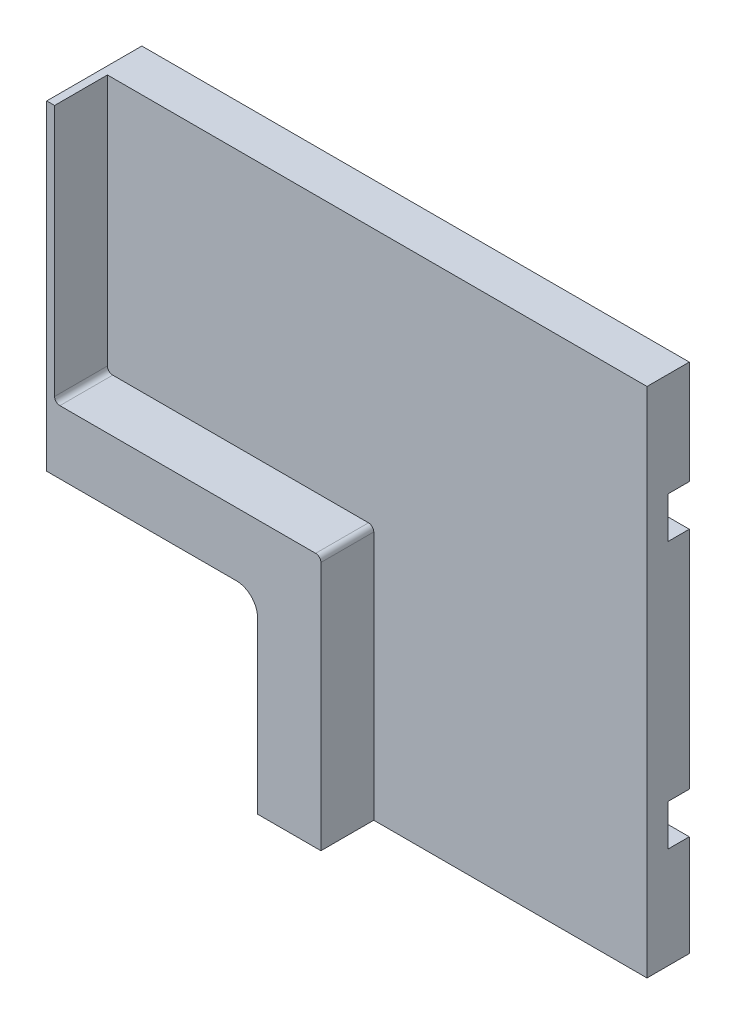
ISO-10303-21;
HEADER;
FILE_DESCRIPTION(('STEP AP214'),'2;1');
FILE_NAME('part.step','',(''),(''),'','','');
FILE_SCHEMA(('AUTOMOTIVE_DESIGN { 1 0 10303 214 1 1 1 1 }'));
ENDSEC;
DATA;
#1=APPLICATION_CONTEXT('core data for automotive mechanical design processes');
#2=APPLICATION_PROTOCOL_DEFINITION('international standard','automotive_design',2000,#1);
#3=PRODUCT_CONTEXT('',#1,'mechanical');
#4=PRODUCT('Part','Part','',(#3));
#5=PRODUCT_RELATED_PRODUCT_CATEGORY('part','',(#4));
#6=PRODUCT_DEFINITION_FORMATION('','',#4);
#7=PRODUCT_DEFINITION_CONTEXT('part definition',#1,'design');
#8=PRODUCT_DEFINITION('design','',#6,#7);
#9=PRODUCT_DEFINITION_SHAPE('','',#8);
#10=(LENGTH_UNIT() NAMED_UNIT(*) SI_UNIT(.MILLI.,.METRE.));
#11=(NAMED_UNIT(*) PLANE_ANGLE_UNIT() SI_UNIT($,.RADIAN.));
#12=(NAMED_UNIT(*) SI_UNIT($,.STERADIAN.) SOLID_ANGLE_UNIT());
#13=UNCERTAINTY_MEASURE_WITH_UNIT(LENGTH_MEASURE(1.E-05),#10,'distance_accuracy_value','');
#14=(GEOMETRIC_REPRESENTATION_CONTEXT(3) GLOBAL_UNCERTAINTY_ASSIGNED_CONTEXT((#13)) GLOBAL_UNIT_ASSIGNED_CONTEXT((#10,
#11,#12)) REPRESENTATION_CONTEXT('',''));
#15=CARTESIAN_POINT('',(0.,0.,0.));
#16=DIRECTION('',(0.,0.,1.));
#17=DIRECTION('',(1.,0.,0.));
#18=AXIS2_PLACEMENT_3D('',#15,#16,#17);
#19=CARTESIAN_POINT('',(0.,0.,4.));
#20=DIRECTION('',(0.,0.,1.));
#21=DIRECTION('',(1.,0.,0.));
#22=AXIS2_PLACEMENT_3D('',#19,#20,#21);
#23=PLANE('',#22);
#24=DIRECTION('',(0.,1.,0.));
#25=VECTOR('',#24,1.);
#26=CARTESIAN_POINT('',(-24.5501886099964,0.,4.));
#27=LINE('',#26,#25);
#28=CARTESIAN_POINT('',(-24.5501886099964,-74.52170155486,4.));
#29=VERTEX_POINT('',#28);
#30=CARTESIAN_POINT('',(-24.5501886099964,-26.0548775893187,4.));
#31=VERTEX_POINT('',#30);
#32=EDGE_CURVE('E315',#29,#31,#27,.T.);
#33=ORIENTED_EDGE('',*,*,#32,.T.);
#34=DIRECTION('',(-1.,0.,0.));
#35=VECTOR('',#34,1.);
#36=CARTESIAN_POINT('',(0.,-26.0548775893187,4.));
#37=LINE('',#36,#35);
#38=CARTESIAN_POINT('',(-75.6,-26.0548775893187,4.));
#39=VERTEX_POINT('',#38);
#40=EDGE_CURVE('E334',#31,#39,#37,.T.);
#41=ORIENTED_EDGE('',*,*,#40,.T.);
#42=DIRECTION('',(0.,-1.,0.));
#43=VECTOR('',#42,1.);
#44=CARTESIAN_POINT('',(-75.6,50.4000000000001,4.));
#45=LINE('',#44,#43);
#46=CARTESIAN_POINT('',(-75.6,-49.9,4.));
#47=VERTEX_POINT('',#46);
#48=EDGE_CURVE('E430',#39,#47,#45,.T.);
#49=ORIENTED_EDGE('',*,*,#48,.T.);
#50=CARTESIAN_POINT('',(-75.1,-49.9000000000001,4.));
#51=DIRECTION('',(0.,0.,1.));
#52=DIRECTION('',(1.,0.,0.));
#53=AXIS2_PLACEMENT_3D('',#50,#51,#52);
#54=CIRCLE('',#53,0.5);
#55=CARTESIAN_POINT('',(-75.1,-50.4000000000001,4.));
#56=VERTEX_POINT('',#55);
#57=EDGE_CURVE('E573',#47,#56,#54,.T.);
#58=ORIENTED_EDGE('',*,*,#57,.T.);
#59=DIRECTION('',(1.,0.,0.));
#60=VECTOR('',#59,1.);
#61=CARTESIAN_POINT('',(-75.6,-50.4000000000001,4.));
#62=LINE('',#61,#60);
#63=CARTESIAN_POINT('',(-50.9,-50.4000000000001,4.));
#64=VERTEX_POINT('',#63);
#65=EDGE_CURVE('E543',#56,#64,#62,.T.);
#66=ORIENTED_EDGE('',*,*,#65,.T.);
#67=CARTESIAN_POINT('',(-50.9,-50.9000000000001,4.));
#68=DIRECTION('',(0.,0.,1.));
#69=DIRECTION('',(1.,0.,0.));
#70=AXIS2_PLACEMENT_3D('',#67,#68,#69);
#71=CIRCLE('',#70,0.5);
#72=CARTESIAN_POINT('',(-50.4,-50.9000000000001,4.));
#73=VERTEX_POINT('',#72);
#74=EDGE_CURVE('E590',#64,#73,#71,.F.);
#75=ORIENTED_EDGE('',*,*,#74,.T.);
#76=DIRECTION('',(0.,-1.,0.));
#77=VECTOR('',#76,1.);
#78=CARTESIAN_POINT('',(-50.4,-50.4000000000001,4.));
#79=LINE('',#78,#77);
#80=CARTESIAN_POINT('',(-50.4,-74.52170155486,4.));
#81=VERTEX_POINT('',#80);
#82=EDGE_CURVE('E538',#73,#81,#79,.T.);
#83=ORIENTED_EDGE('',*,*,#82,.T.);
#84=DIRECTION('',(1.,0.,0.));
#85=VECTOR('',#84,1.);
#86=CARTESIAN_POINT('',(0.,-74.52170155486,4.));
#87=LINE('',#86,#85);
#88=EDGE_CURVE('E323',#81,#29,#87,.T.);
#89=ORIENTED_EDGE('',*,*,#88,.T.);
#90=EDGE_LOOP('',(#33,#41,#49,#58,#66,#75,#83,#89));
#91=FACE_BOUND('',#90,.T.);
#92=ADVANCED_FACE('F49',(#91),#23,.T.);
#93=CARTESIAN_POINT('',(0.,0.,9.));
#94=DIRECTION('',(0.,0.,1.));
#95=DIRECTION('',(1.,0.,0.));
#96=AXIS2_PLACEMENT_3D('',#93,#94,#95);
#97=PLANE('',#96);
#98=DIRECTION('',(0.,-1.,0.));
#99=VECTOR('',#98,1.);
#100=CARTESIAN_POINT('',(-75.6,50.4000000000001,9.00000000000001));
#101=LINE('',#100,#99);
#102=CARTESIAN_POINT('',(-75.6,-26.0548775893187,9.00000000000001));
#103=VERTEX_POINT('',#102);
#104=CARTESIAN_POINT('',(-75.6,-49.9000000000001,9.00000000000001));
#105=VERTEX_POINT('',#104);
#106=EDGE_CURVE('E542',#103,#105,#101,.T.);
#107=ORIENTED_EDGE('',*,*,#106,.F.);
#108=DIRECTION('',(-1.,0.,0.));
#109=VECTOR('',#108,1.);
#110=CARTESIAN_POINT('',(0.,-26.0548775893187,9.));
#111=LINE('',#110,#109);
#112=CARTESIAN_POINT('',(-76.3431671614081,-26.0548775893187,9.));
#113=VERTEX_POINT('',#112);
#114=EDGE_CURVE('E331',#103,#113,#111,.T.);
#115=ORIENTED_EDGE('',*,*,#114,.T.);
#116=DIRECTION('',(0.,-1.,0.));
#117=VECTOR('',#116,1.);
#118=CARTESIAN_POINT('',(-76.3431671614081,0.,9.));
#119=LINE('',#118,#117);
#120=CARTESIAN_POINT('',(-76.3431671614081,-56.4000000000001,9.00000000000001));
#121=VERTEX_POINT('',#120);
#122=EDGE_CURVE('E272',#113,#121,#119,.T.);
#123=ORIENTED_EDGE('',*,*,#122,.T.);
#124=DIRECTION('',(1.,0.,0.));
#125=VECTOR('',#124,1.);
#126=CARTESIAN_POINT('',(-81.6,-56.4000000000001,9.));
#127=LINE('',#126,#125);
#128=CARTESIAN_POINT('',(-58.4,-56.4000000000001,9.));
#129=VERTEX_POINT('',#128);
#130=EDGE_CURVE('E553',#121,#129,#127,.T.);
#131=ORIENTED_EDGE('',*,*,#130,.T.);
#132=CARTESIAN_POINT('',(-58.4,-58.4000000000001,9.00000000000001));
#133=DIRECTION('',(0.,0.,1.));
#134=DIRECTION('',(1.,0.,0.));
#135=AXIS2_PLACEMENT_3D('',#132,#133,#134);
#136=CIRCLE('',#135,2.);
#137=CARTESIAN_POINT('',(-56.4,-58.4000000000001,9.));
#138=VERTEX_POINT('',#137);
#139=EDGE_CURVE('E604',#129,#138,#136,.F.);
#140=ORIENTED_EDGE('',*,*,#139,.T.);
#141=DIRECTION('',(0.,-1.,0.));
#142=VECTOR('',#141,1.);
#143=CARTESIAN_POINT('',(-56.4,-56.4000000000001,9.));
#144=LINE('',#143,#142);
#145=CARTESIAN_POINT('',(-56.4,-74.52170155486,9.));
#146=VERTEX_POINT('',#145);
#147=EDGE_CURVE('E562',#138,#146,#144,.T.);
#148=ORIENTED_EDGE('',*,*,#147,.T.);
#149=DIRECTION('',(1.,0.,0.));
#150=VECTOR('',#149,1.);
#151=CARTESIAN_POINT('',(0.,-74.52170155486,9.));
#152=LINE('',#151,#150);
#153=CARTESIAN_POINT('',(-50.4,-74.52170155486,9.00000000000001));
#154=VERTEX_POINT('',#153);
#155=EDGE_CURVE('E319',#146,#154,#152,.T.);
#156=ORIENTED_EDGE('',*,*,#155,.T.);
#157=DIRECTION('',(0.,-1.,0.));
#158=VECTOR('',#157,1.);
#159=CARTESIAN_POINT('',(-50.4,-50.4000000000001,9.00000000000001));
#160=LINE('',#159,#158);
#161=CARTESIAN_POINT('',(-50.4,-50.9000000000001,9.00000000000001));
#162=VERTEX_POINT('',#161);
#163=EDGE_CURVE('E549',#162,#154,#160,.T.);
#164=ORIENTED_EDGE('',*,*,#163,.F.);
#165=CARTESIAN_POINT('',(-50.9,-50.9000000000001,9.00000000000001));
#166=DIRECTION('',(0.,0.,1.));
#167=DIRECTION('',(1.,0.,0.));
#168=AXIS2_PLACEMENT_3D('',#165,#166,#167);
#169=CIRCLE('',#168,0.5);
#170=CARTESIAN_POINT('',(-50.9,-50.4000000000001,9.00000000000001));
#171=VERTEX_POINT('',#170);
#172=EDGE_CURVE('E583',#162,#171,#169,.T.);
#173=ORIENTED_EDGE('',*,*,#172,.T.);
#174=DIRECTION('',(1.,0.,0.));
#175=VECTOR('',#174,1.);
#176=CARTESIAN_POINT('',(-75.6,-50.4000000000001,9.00000000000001));
#177=LINE('',#176,#175);
#178=CARTESIAN_POINT('',(-75.1,-50.4000000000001,9.00000000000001));
#179=VERTEX_POINT('',#178);
#180=EDGE_CURVE('E554',#179,#171,#177,.T.);
#181=ORIENTED_EDGE('',*,*,#180,.F.);
#182=CARTESIAN_POINT('',(-75.1,-49.9000000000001,9.00000000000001));
#183=DIRECTION('',(0.,0.,1.));
#184=DIRECTION('',(1.,0.,0.));
#185=AXIS2_PLACEMENT_3D('',#182,#183,#184);
#186=CIRCLE('',#185,0.5);
#187=EDGE_CURVE('E593',#179,#105,#186,.F.);
#188=ORIENTED_EDGE('',*,*,#187,.T.);
#189=EDGE_LOOP('',(#107,#115,#123,#131,#140,#148,#156,#164,#173,#181,#188));
#190=FACE_BOUND('',#189,.T.);
#191=ADVANCED_FACE('F678',(#190),#97,.T.);
#192=CARTESIAN_POINT('',(-56.4,-56.4000000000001,-230.799653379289));
#193=DIRECTION('',(-1.,0.,0.));
#194=DIRECTION('',(0.,-1.,0.));
#195=AXIS2_PLACEMENT_3D('',#192,#193,#194);
#196=PLANE('',#195);
#197=DIRECTION('',(0.,1.,0.));
#198=VECTOR('',#197,1.);
#199=CARTESIAN_POINT('',(-56.4,-56.4000000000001,0.));
#200=LINE('',#199,#198);
#201=CARTESIAN_POINT('',(-56.4,-74.52170155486,0.));
#202=VERTEX_POINT('',#201);
#203=CARTESIAN_POINT('',(-56.4,-58.4000000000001,0.));
#204=VERTEX_POINT('',#203);
#205=EDGE_CURVE('E73',#202,#204,#200,.T.);
#206=ORIENTED_EDGE('',*,*,#205,.F.);
#207=DIRECTION('',(0.,0.,1.));
#208=VECTOR('',#207,1.);
#209=CARTESIAN_POINT('',(-56.4,-74.52170155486,-230.799653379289));
#210=LINE('',#209,#208);
#211=EDGE_CURVE('E327',#202,#146,#210,.T.);
#212=ORIENTED_EDGE('',*,*,#211,.T.);
#213=ORIENTED_EDGE('',*,*,#147,.F.);
#214=DIRECTION('',(0.,0.,1.));
#215=VECTOR('',#214,1.);
#216=CARTESIAN_POINT('',(-56.4,-58.4000000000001,0.));
#217=LINE('',#216,#215);
#218=EDGE_CURVE('E601',#138,#204,#217,.F.);
#219=ORIENTED_EDGE('',*,*,#218,.T.);
#220=EDGE_LOOP('',(#206,#212,#213,#219));
#221=FACE_BOUND('',#220,.T.);
#222=ADVANCED_FACE('F685',(#221),#196,.T.);
#223=CARTESIAN_POINT('',(-81.6,-56.4000000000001,-230.799653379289));
#224=DIRECTION('',(0.,-1.,0.));
#225=DIRECTION('',(0.,0.,-1.));
#226=AXIS2_PLACEMENT_3D('',#223,#224,#225);
#227=PLANE('',#226);
#228=ORIENTED_EDGE('',*,*,#130,.F.);
#229=DIRECTION('',(0.,0.,-1.));
#230=VECTOR('',#229,1.);
#231=CARTESIAN_POINT('',(-76.3431671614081,-56.4000000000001,-230.799653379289));
#232=LINE('',#231,#230);
#233=CARTESIAN_POINT('',(-76.3431671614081,-56.4000000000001,0.));
#234=VERTEX_POINT('',#233);
#235=EDGE_CURVE('E338',#121,#234,#232,.T.);
#236=ORIENTED_EDGE('',*,*,#235,.T.);
#237=DIRECTION('',(-1.,0.,0.));
#238=VECTOR('',#237,1.);
#239=CARTESIAN_POINT('',(-81.6,-56.4000000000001,0.));
#240=LINE('',#239,#238);
#241=CARTESIAN_POINT('',(-58.4,-56.4000000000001,0.));
#242=VERTEX_POINT('',#241);
#243=EDGE_CURVE('E291',#242,#234,#240,.T.);
#244=ORIENTED_EDGE('',*,*,#243,.F.);
#245=DIRECTION('',(0.,0.,1.));
#246=VECTOR('',#245,1.);
#247=CARTESIAN_POINT('',(-58.4,-56.4000000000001,9.00000000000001));
#248=LINE('',#247,#246);
#249=EDGE_CURVE('E597',#242,#129,#248,.T.);
#250=ORIENTED_EDGE('',*,*,#249,.T.);
#251=EDGE_LOOP('',(#228,#236,#244,#250));
#252=FACE_BOUND('',#251,.T.);
#253=ADVANCED_FACE('F706',(#252),#227,.T.);
#254=CARTESIAN_POINT('',(0.,0.,0.));
#255=DIRECTION('',(0.,0.,1.));
#256=DIRECTION('',(1.,0.,0.));
#257=AXIS2_PLACEMENT_3D('',#254,#255,#256);
#258=PLANE('',#257);
#259=DIRECTION('',(0.,-1.,0.));
#260=VECTOR('',#259,1.);
#261=CARTESIAN_POINT('',(-24.5501886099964,-26.0548775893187,0.));
#262=LINE('',#261,#260);
#263=CARTESIAN_POINT('',(-24.5501886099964,-39.7499999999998,0.));
#264=VERTEX_POINT('',#263);
#265=CARTESIAN_POINT('',(-24.5501886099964,-61.05,0.));
#266=VERTEX_POINT('',#265);
#267=EDGE_CURVE('E646',#264,#266,#262,.T.);
#268=ORIENTED_EDGE('',*,*,#267,.T.);
#269=DIRECTION('',(1.,0.,0.));
#270=VECTOR('',#269,1.);
#271=CARTESIAN_POINT('',(-34.25,-61.05,0.));
#272=LINE('',#271,#270);
#273=CARTESIAN_POINT('',(-36.05,-61.05,0.));
#274=VERTEX_POINT('',#273);
#275=EDGE_CURVE('E512',#274,#266,#272,.T.);
#276=ORIENTED_EDGE('',*,*,#275,.F.);
#277=DIRECTION('',(0.,-1.,0.));
#278=VECTOR('',#277,1.);
#279=CARTESIAN_POINT('',(-36.05,-61.05,0.));
#280=LINE('',#279,#278);
#281=CARTESIAN_POINT('',(-36.05,-60.85,0.));
#282=VERTEX_POINT('',#281);
#283=EDGE_CURVE('E531',#282,#274,#280,.T.);
#284=ORIENTED_EDGE('',*,*,#283,.F.);
#285=DIRECTION('',(1.,0.,0.));
#286=VECTOR('',#285,1.);
#287=CARTESIAN_POINT('',(-36.05,-60.85,0.));
#288=LINE('',#287,#286);
#289=CARTESIAN_POINT('',(-39.55,-60.85,0.));
#290=VERTEX_POINT('',#289);
#291=EDGE_CURVE('E527',#290,#282,#288,.T.);
#292=ORIENTED_EDGE('',*,*,#291,.F.);
#293=DIRECTION('',(0.,1.,0.));
#294=VECTOR('',#293,1.);
#295=CARTESIAN_POINT('',(-39.55,-60.85,0.));
#296=LINE('',#295,#294);
#297=CARTESIAN_POINT('',(-39.55,-65.15,0.));
#298=VERTEX_POINT('',#297);
#299=EDGE_CURVE('E523',#298,#290,#296,.T.);
#300=ORIENTED_EDGE('',*,*,#299,.F.);
#301=DIRECTION('',(-1.,0.,0.));
#302=VECTOR('',#301,1.);
#303=CARTESIAN_POINT('',(-39.55,-65.15,0.));
#304=LINE('',#303,#302);
#305=CARTESIAN_POINT('',(-36.05,-65.15,0.));
#306=VERTEX_POINT('',#305);
#307=EDGE_CURVE('E519',#306,#298,#304,.T.);
#308=ORIENTED_EDGE('',*,*,#307,.F.);
#309=DIRECTION('',(0.,-1.,0.));
#310=VECTOR('',#309,1.);
#311=CARTESIAN_POINT('',(-36.05,-65.15,0.));
#312=LINE('',#311,#310);
#313=CARTESIAN_POINT('',(-36.05,-64.95,0.));
#314=VERTEX_POINT('',#313);
#315=EDGE_CURVE('E515',#314,#306,#312,.T.);
#316=ORIENTED_EDGE('',*,*,#315,.F.);
#317=DIRECTION('',(-1.,0.,0.));
#318=VECTOR('',#317,1.);
#319=CARTESIAN_POINT('',(-36.05,-64.95,0.));
#320=LINE('',#319,#318);
#321=CARTESIAN_POINT('',(-24.5501886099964,-64.95,0.));
#322=VERTEX_POINT('',#321);
#323=EDGE_CURVE('E371',#322,#314,#320,.T.);
#324=ORIENTED_EDGE('',*,*,#323,.F.);
#325=CARTESIAN_POINT('',(-24.5501886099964,-74.52170155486,0.));
#326=VERTEX_POINT('',#325);
#327=EDGE_CURVE('E649',#322,#326,#262,.T.);
#328=ORIENTED_EDGE('',*,*,#327,.T.);
#329=DIRECTION('',(-1.,0.,0.));
#330=VECTOR('',#329,1.);
#331=CARTESIAN_POINT('',(-24.5501886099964,-74.52170155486,0.));
#332=LINE('',#331,#330);
#333=EDGE_CURVE('E293',#326,#202,#332,.T.);
#334=ORIENTED_EDGE('',*,*,#333,.T.);
#335=ORIENTED_EDGE('',*,*,#205,.T.);
#336=CARTESIAN_POINT('',(-58.4,-58.4000000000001,0.));
#337=DIRECTION('',(0.,0.,1.));
#338=DIRECTION('',(1.,0.,0.));
#339=AXIS2_PLACEMENT_3D('',#336,#337,#338);
#340=CIRCLE('',#339,2.);
#341=EDGE_CURVE('E607',#204,#242,#340,.T.);
#342=ORIENTED_EDGE('',*,*,#341,.T.);
#343=ORIENTED_EDGE('',*,*,#243,.T.);
#344=DIRECTION('',(0.,1.,0.));
#345=VECTOR('',#344,1.);
#346=CARTESIAN_POINT('',(-76.3431671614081,-26.0548775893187,0.));
#347=LINE('',#346,#345);
#348=CARTESIAN_POINT('',(-76.3431671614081,-26.0548775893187,0.));
#349=VERTEX_POINT('',#348);
#350=EDGE_CURVE('E269',#234,#349,#347,.T.);
#351=ORIENTED_EDGE('',*,*,#350,.T.);
#352=DIRECTION('',(1.,0.,0.));
#353=VECTOR('',#352,1.);
#354=CARTESIAN_POINT('',(-24.5501886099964,-26.0548775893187,0.));
#355=LINE('',#354,#353);
#356=CARTESIAN_POINT('',(-24.5501886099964,-26.0548775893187,0.));
#357=VERTEX_POINT('',#356);
#358=EDGE_CURVE('E280',#349,#357,#355,.T.);
#359=ORIENTED_EDGE('',*,*,#358,.T.);
#360=CARTESIAN_POINT('',(-24.5501886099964,-35.8499999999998,0.));
#361=VERTEX_POINT('',#360);
#362=EDGE_CURVE('E296',#357,#361,#262,.T.);
#363=ORIENTED_EDGE('',*,*,#362,.T.);
#364=DIRECTION('',(1.,0.,0.));
#365=VECTOR('',#364,1.);
#366=CARTESIAN_POINT('',(-59.45,-35.8500000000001,0.));
#367=LINE('',#366,#365);
#368=CARTESIAN_POINT('',(-61.25,-35.8500000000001,0.));
#369=VERTEX_POINT('',#368);
#370=EDGE_CURVE('E426',#369,#361,#367,.T.);
#371=ORIENTED_EDGE('',*,*,#370,.F.);
#372=DIRECTION('',(0.,-1.,0.));
#373=VECTOR('',#372,1.);
#374=CARTESIAN_POINT('',(-61.25,-35.8500000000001,0.));
#375=LINE('',#374,#373);
#376=CARTESIAN_POINT('',(-61.25,-35.6500000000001,0.));
#377=VERTEX_POINT('',#376);
#378=EDGE_CURVE('E447',#377,#369,#375,.T.);
#379=ORIENTED_EDGE('',*,*,#378,.F.);
#380=DIRECTION('',(1.,0.,0.));
#381=VECTOR('',#380,1.);
#382=CARTESIAN_POINT('',(-61.25,-35.6500000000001,0.));
#383=LINE('',#382,#381);
#384=CARTESIAN_POINT('',(-64.75,-35.6500000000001,0.));
#385=VERTEX_POINT('',#384);
#386=EDGE_CURVE('E443',#385,#377,#383,.T.);
#387=ORIENTED_EDGE('',*,*,#386,.F.);
#388=DIRECTION('',(0.,1.,0.));
#389=VECTOR('',#388,1.);
#390=CARTESIAN_POINT('',(-64.75,-35.6500000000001,0.));
#391=LINE('',#390,#389);
#392=CARTESIAN_POINT('',(-64.75,-39.9500000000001,0.));
#393=VERTEX_POINT('',#392);
#394=EDGE_CURVE('E439',#393,#385,#391,.T.);
#395=ORIENTED_EDGE('',*,*,#394,.F.);
#396=DIRECTION('',(-1.,0.,0.));
#397=VECTOR('',#396,1.);
#398=CARTESIAN_POINT('',(-64.75,-39.9500000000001,0.));
#399=LINE('',#398,#397);
#400=CARTESIAN_POINT('',(-61.25,-39.9500000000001,0.));
#401=VERTEX_POINT('',#400);
#402=EDGE_CURVE('E435',#401,#393,#399,.T.);
#403=ORIENTED_EDGE('',*,*,#402,.F.);
#404=DIRECTION('',(0.,-1.,0.));
#405=VECTOR('',#404,1.);
#406=CARTESIAN_POINT('',(-61.25,-39.9500000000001,0.));
#407=LINE('',#406,#405);
#408=CARTESIAN_POINT('',(-61.25,-39.7500000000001,0.));
#409=VERTEX_POINT('',#408);
#410=EDGE_CURVE('E431',#409,#401,#407,.T.);
#411=ORIENTED_EDGE('',*,*,#410,.F.);
#412=DIRECTION('',(-1.,0.,0.));
#413=VECTOR('',#412,1.);
#414=CARTESIAN_POINT('',(-61.25,-39.7500000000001,0.));
#415=LINE('',#414,#413);
#416=EDGE_CURVE('E427',#264,#409,#415,.T.);
#417=ORIENTED_EDGE('',*,*,#416,.F.);
#418=EDGE_LOOP('',(#268,#276,#284,#292,#300,#308,#316,#324,#328,#334,#335,#342,#343,#351,#359,
#363,#371,#379,#387,#395,#403,#411,#417));
#419=FACE_BOUND('',#418,.T.);
#420=ADVANCED_FACE('F289',(#419),#258,.F.);
#421=CARTESIAN_POINT('',(-75.6,50.4000000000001,222.829090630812));
#422=DIRECTION('',(1.,0.,0.));
#423=DIRECTION('',(0.,0.,-1.));
#424=AXIS2_PLACEMENT_3D('',#421,#422,#423);
#425=PLANE('',#424);
#426=ORIENTED_EDGE('',*,*,#48,.F.);
#427=DIRECTION('',(0.,0.,1.));
#428=VECTOR('',#427,1.);
#429=CARTESIAN_POINT('',(-75.6,-26.0548775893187,222.829090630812));
#430=LINE('',#429,#428);
#431=EDGE_CURVE('E13',#39,#103,#430,.T.);
#432=ORIENTED_EDGE('',*,*,#431,.T.);
#433=ORIENTED_EDGE('',*,*,#106,.T.);
#434=DIRECTION('',(0.,0.,-1.));
#435=VECTOR('',#434,1.);
#436=CARTESIAN_POINT('',(-75.6,-49.9000000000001,4.));
#437=LINE('',#436,#435);
#438=EDGE_CURVE('E586',#105,#47,#437,.T.);
#439=ORIENTED_EDGE('',*,*,#438,.T.);
#440=EDGE_LOOP('',(#426,#432,#433,#439));
#441=FACE_BOUND('',#440,.T.);
#442=ADVANCED_FACE('F694',(#441),#425,.T.);
#443=CARTESIAN_POINT('',(-50.4,-50.4000000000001,222.829090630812));
#444=DIRECTION('',(1.,0.,0.));
#445=DIRECTION('',(0.,1.,0.));
#446=AXIS2_PLACEMENT_3D('',#443,#444,#445);
#447=PLANE('',#446);
#448=ORIENTED_EDGE('',*,*,#163,.T.);
#449=DIRECTION('',(0.,0.,-1.));
#450=VECTOR('',#449,1.);
#451=CARTESIAN_POINT('',(-50.4,-74.52170155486,222.829090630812));
#452=LINE('',#451,#450);
#453=EDGE_CURVE('E58',#154,#81,#452,.T.);
#454=ORIENTED_EDGE('',*,*,#453,.T.);
#455=ORIENTED_EDGE('',*,*,#82,.F.);
#456=DIRECTION('',(0.,0.,-1.));
#457=VECTOR('',#456,1.);
#458=CARTESIAN_POINT('',(-50.4,-50.9000000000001,222.829090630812));
#459=LINE('',#458,#457);
#460=EDGE_CURVE('E565',#73,#162,#459,.F.);
#461=ORIENTED_EDGE('',*,*,#460,.T.);
#462=EDGE_LOOP('',(#448,#454,#455,#461));
#463=FACE_BOUND('',#462,.T.);
#464=ADVANCED_FACE('F691',(#463),#447,.T.);
#465=CARTESIAN_POINT('',(-36.05,-64.95,10.8249542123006));
#466=DIRECTION('',(0.,-1.,0.));
#467=DIRECTION('',(0.,0.,-1.));
#468=AXIS2_PLACEMENT_3D('',#465,#466,#467);
#469=PLANE('',#468);
#470=DIRECTION('',(0.,0.,1.));
#471=VECTOR('',#470,1.);
#472=CARTESIAN_POINT('',(-24.5501886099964,-64.95,10.8249542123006));
#473=LINE('',#472,#471);
#474=CARTESIAN_POINT('',(-24.5501886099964,-64.95,2.));
#475=VERTEX_POINT('',#474);
#476=EDGE_CURVE('E312',#322,#475,#473,.T.);
#477=ORIENTED_EDGE('',*,*,#476,.F.);
#478=ORIENTED_EDGE('',*,*,#323,.T.);
#479=DIRECTION('',(0.,0.,-1.));
#480=VECTOR('',#479,1.);
#481=CARTESIAN_POINT('',(-36.05,-64.95,10.8249542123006));
#482=LINE('',#481,#480);
#483=CARTESIAN_POINT('',(-36.05,-64.95,3.6));
#484=VERTEX_POINT('',#483);
#485=EDGE_CURVE('E458',#484,#314,#482,.T.);
#486=ORIENTED_EDGE('',*,*,#485,.F.);
#487=DIRECTION('',(-1.,0.,0.));
#488=VECTOR('',#487,1.);
#489=CARTESIAN_POINT('',(-36.05,-64.95,3.6));
#490=LINE('',#489,#488);
#491=CARTESIAN_POINT('',(-34.25,-64.95,3.6));
#492=VERTEX_POINT('',#491);
#493=EDGE_CURVE('E462',#492,#484,#490,.T.);
#494=ORIENTED_EDGE('',*,*,#493,.F.);
#495=DIRECTION('',(0.,0.,-1.));
#496=VECTOR('',#495,1.);
#497=CARTESIAN_POINT('',(-34.25,-64.95,10.8249542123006));
#498=LINE('',#497,#496);
#499=CARTESIAN_POINT('',(-34.25,-64.95,2.));
#500=VERTEX_POINT('',#499);
#501=EDGE_CURVE('E365',#492,#500,#498,.T.);
#502=ORIENTED_EDGE('',*,*,#501,.T.);
#503=DIRECTION('',(-1.,0.,0.));
#504=VECTOR('',#503,1.);
#505=CARTESIAN_POINT('',(1.94999999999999,-64.95,2.));
#506=LINE('',#505,#504);
#507=EDGE_CURVE('E343',#475,#500,#506,.T.);
#508=ORIENTED_EDGE('',*,*,#507,.F.);
#509=EDGE_LOOP('',(#477,#478,#486,#494,#502,#508));
#510=FACE_BOUND('',#509,.T.);
#511=ADVANCED_FACE('F658',(#510),#469,.F.);
#512=CARTESIAN_POINT('',(-34.25,-61.05,10.8249542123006));
#513=DIRECTION('',(0.,1.,0.));
#514=DIRECTION('',(0.,0.,1.));
#515=AXIS2_PLACEMENT_3D('',#512,#513,#514);
#516=PLANE('',#515);
#517=DIRECTION('',(0.,0.,-1.));
#518=VECTOR('',#517,1.);
#519=CARTESIAN_POINT('',(-24.5501886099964,-61.05,10.8249542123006));
#520=LINE('',#519,#518);
#521=CARTESIAN_POINT('',(-24.5501886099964,-61.05,2.));
#522=VERTEX_POINT('',#521);
#523=EDGE_CURVE('E309',#522,#266,#520,.T.);
#524=ORIENTED_EDGE('',*,*,#523,.F.);
#525=DIRECTION('',(1.,0.,0.));
#526=VECTOR('',#525,1.);
#527=CARTESIAN_POINT('',(-34.25,-61.05,2.));
#528=LINE('',#527,#526);
#529=CARTESIAN_POINT('',(-34.25,-61.05,2.));
#530=VERTEX_POINT('',#529);
#531=EDGE_CURVE('E350',#530,#522,#528,.T.);
#532=ORIENTED_EDGE('',*,*,#531,.F.);
#533=DIRECTION('',(0.,0.,-1.));
#534=VECTOR('',#533,1.);
#535=CARTESIAN_POINT('',(-34.25,-61.05,10.8249542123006));
#536=LINE('',#535,#534);
#537=CARTESIAN_POINT('',(-34.25,-61.05,3.6));
#538=VERTEX_POINT('',#537);
#539=EDGE_CURVE('E484',#538,#530,#536,.T.);
#540=ORIENTED_EDGE('',*,*,#539,.F.);
#541=DIRECTION('',(1.,0.,0.));
#542=VECTOR('',#541,1.);
#543=CARTESIAN_POINT('',(-34.25,-61.05,3.6));
#544=LINE('',#543,#542);
#545=CARTESIAN_POINT('',(-36.05,-61.05,3.6));
#546=VERTEX_POINT('',#545);
#547=EDGE_CURVE('E483',#546,#538,#544,.T.);
#548=ORIENTED_EDGE('',*,*,#547,.F.);
#549=DIRECTION('',(0.,0.,-1.));
#550=VECTOR('',#549,1.);
#551=CARTESIAN_POINT('',(-36.05,-61.05,10.8249542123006));
#552=LINE('',#551,#550);
#553=EDGE_CURVE('E480',#546,#274,#552,.T.);
#554=ORIENTED_EDGE('',*,*,#553,.T.);
#555=ORIENTED_EDGE('',*,*,#275,.T.);
#556=EDGE_LOOP('',(#524,#532,#540,#548,#554,#555));
#557=FACE_BOUND('',#556,.T.);
#558=ADVANCED_FACE('F625',(#557),#516,.F.);
#559=CARTESIAN_POINT('',(-61.25,-39.7500000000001,10.8249542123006));
#560=DIRECTION('',(0.,-1.,0.));
#561=DIRECTION('',(1.,0.,0.));
#562=AXIS2_PLACEMENT_3D('',#559,#560,#561);
#563=PLANE('',#562);
#564=DIRECTION('',(0.,0.,1.));
#565=VECTOR('',#564,1.);
#566=CARTESIAN_POINT('',(-24.5501886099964,-39.7499999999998,10.8249542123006));
#567=LINE('',#566,#565);
#568=CARTESIAN_POINT('',(-24.5501886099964,-39.7500000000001,2.));
#569=VERTEX_POINT('',#568);
#570=EDGE_CURVE('E65',#264,#569,#567,.T.);
#571=ORIENTED_EDGE('',*,*,#570,.F.);
#572=ORIENTED_EDGE('',*,*,#416,.T.);
#573=DIRECTION('',(0.,0.,-1.));
#574=VECTOR('',#573,1.);
#575=CARTESIAN_POINT('',(-61.25,-39.7500000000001,10.8249542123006));
#576=LINE('',#575,#574);
#577=CARTESIAN_POINT('',(-61.25,-39.7500000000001,3.6));
#578=VERTEX_POINT('',#577);
#579=EDGE_CURVE('E372',#578,#409,#576,.T.);
#580=ORIENTED_EDGE('',*,*,#579,.F.);
#581=DIRECTION('',(-1.,0.,0.));
#582=VECTOR('',#581,1.);
#583=CARTESIAN_POINT('',(-61.25,-39.7500000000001,3.6));
#584=LINE('',#583,#582);
#585=CARTESIAN_POINT('',(-59.45,-39.7500000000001,3.6));
#586=VERTEX_POINT('',#585);
#587=EDGE_CURVE('E376',#586,#578,#584,.T.);
#588=ORIENTED_EDGE('',*,*,#587,.F.);
#589=DIRECTION('',(0.,0.,-1.));
#590=VECTOR('',#589,1.);
#591=CARTESIAN_POINT('',(-59.45,-39.7500000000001,10.8249542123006));
#592=LINE('',#591,#590);
#593=CARTESIAN_POINT('',(-59.45,-39.7500000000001,2.));
#594=VERTEX_POINT('',#593);
#595=EDGE_CURVE('E366',#586,#594,#592,.T.);
#596=ORIENTED_EDGE('',*,*,#595,.T.);
#597=DIRECTION('',(-1.,0.,0.));
#598=VECTOR('',#597,1.);
#599=CARTESIAN_POINT('',(-59.45,-39.7500000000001,2.));
#600=LINE('',#599,#598);
#601=EDGE_CURVE('E354',#569,#594,#600,.T.);
#602=ORIENTED_EDGE('',*,*,#601,.F.);
#603=EDGE_LOOP('',(#571,#572,#580,#588,#596,#602));
#604=FACE_BOUND('',#603,.T.);
#605=ADVANCED_FACE('F769',(#604),#563,.F.);
#606=CARTESIAN_POINT('',(-59.45,-35.8500000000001,10.8249542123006));
#607=DIRECTION('',(0.,1.,0.));
#608=DIRECTION('',(-1.,0.,0.));
#609=AXIS2_PLACEMENT_3D('',#606,#607,#608);
#610=PLANE('',#609);
#611=DIRECTION('',(0.,0.,-1.));
#612=VECTOR('',#611,1.);
#613=CARTESIAN_POINT('',(-24.5501886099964,-35.8499999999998,10.8249542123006));
#614=LINE('',#613,#612);
#615=CARTESIAN_POINT('',(-24.5501886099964,-35.8500000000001,2.));
#616=VERTEX_POINT('',#615);
#617=EDGE_CURVE('E301',#616,#361,#614,.T.);
#618=ORIENTED_EDGE('',*,*,#617,.F.);
#619=DIRECTION('',(1.,0.,0.));
#620=VECTOR('',#619,1.);
#621=CARTESIAN_POINT('',(-59.45,-35.8500000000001,2.));
#622=LINE('',#621,#620);
#623=CARTESIAN_POINT('',(-59.45,-35.8500000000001,2.));
#624=VERTEX_POINT('',#623);
#625=EDGE_CURVE('E361',#624,#616,#622,.T.);
#626=ORIENTED_EDGE('',*,*,#625,.F.);
#627=DIRECTION('',(0.,0.,-1.));
#628=VECTOR('',#627,1.);
#629=CARTESIAN_POINT('',(-59.45,-35.8500000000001,10.8249542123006));
#630=LINE('',#629,#628);
#631=CARTESIAN_POINT('',(-59.45,-35.8500000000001,3.6));
#632=VERTEX_POINT('',#631);
#633=EDGE_CURVE('E398',#632,#624,#630,.T.);
#634=ORIENTED_EDGE('',*,*,#633,.F.);
#635=DIRECTION('',(1.,0.,0.));
#636=VECTOR('',#635,1.);
#637=CARTESIAN_POINT('',(-59.45,-35.8500000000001,3.6));
#638=LINE('',#637,#636);
#639=CARTESIAN_POINT('',(-61.25,-35.8500000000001,3.6));
#640=VERTEX_POINT('',#639);
#641=EDGE_CURVE('E397',#640,#632,#638,.T.);
#642=ORIENTED_EDGE('',*,*,#641,.F.);
#643=DIRECTION('',(0.,0.,-1.));
#644=VECTOR('',#643,1.);
#645=CARTESIAN_POINT('',(-61.25,-35.8500000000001,10.8249542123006));
#646=LINE('',#645,#644);
#647=EDGE_CURVE('E394',#640,#369,#646,.T.);
#648=ORIENTED_EDGE('',*,*,#647,.T.);
#649=ORIENTED_EDGE('',*,*,#370,.T.);
#650=EDGE_LOOP('',(#618,#626,#634,#642,#648,#649));
#651=FACE_BOUND('',#650,.T.);
#652=ADVANCED_FACE('F747',(#651),#610,.F.);
#653=CARTESIAN_POINT('',(0.,0.,2.));
#654=DIRECTION('',(0.,0.,1.));
#655=DIRECTION('',(1.,0.,0.));
#656=AXIS2_PLACEMENT_3D('',#653,#654,#655);
#657=PLANE('',#656);
#658=DIRECTION('',(0.,1.,0.));
#659=VECTOR('',#658,1.);
#660=CARTESIAN_POINT('',(-24.5501886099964,0.,2.));
#661=LINE('',#660,#659);
#662=EDGE_CURVE('E612',#475,#522,#661,.T.);
#663=ORIENTED_EDGE('',*,*,#662,.F.);
#664=ORIENTED_EDGE('',*,*,#507,.T.);
#665=DIRECTION('',(0.,1.,0.));
#666=VECTOR('',#665,1.);
#667=CARTESIAN_POINT('',(-34.25,-64.95,2.));
#668=LINE('',#667,#666);
#669=EDGE_CURVE('E346',#500,#530,#668,.T.);
#670=ORIENTED_EDGE('',*,*,#669,.T.);
#671=ORIENTED_EDGE('',*,*,#531,.T.);
#672=EDGE_LOOP('',(#663,#664,#670,#671));
#673=FACE_BOUND('',#672,.T.);
#674=ADVANCED_FACE('F628',(#673),#657,.F.);
#675=EDGE_CURVE('E610',#569,#616,#661,.T.);
#676=ORIENTED_EDGE('',*,*,#675,.F.);
#677=ORIENTED_EDGE('',*,*,#601,.T.);
#678=DIRECTION('',(0.,1.,0.));
#679=VECTOR('',#678,1.);
#680=CARTESIAN_POINT('',(-59.45,-39.7500000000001,2.));
#681=LINE('',#680,#679);
#682=EDGE_CURVE('E357',#594,#624,#681,.T.);
#683=ORIENTED_EDGE('',*,*,#682,.T.);
#684=ORIENTED_EDGE('',*,*,#625,.T.);
#685=EDGE_LOOP('',(#676,#677,#683,#684));
#686=FACE_BOUND('',#685,.T.);
#687=ADVANCED_FACE('F699',(#686),#657,.F.);
#688=CARTESIAN_POINT('',(-75.6,-50.4000000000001,222.829090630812));
#689=DIRECTION('',(0.,1.,0.));
#690=DIRECTION('',(0.,0.,1.));
#691=AXIS2_PLACEMENT_3D('',#688,#689,#690);
#692=PLANE('',#691);
#693=ORIENTED_EDGE('',*,*,#180,.T.);
#694=DIRECTION('',(0.,0.,-1.));
#695=VECTOR('',#694,1.);
#696=CARTESIAN_POINT('',(-50.9,-50.4000000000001,222.829090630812));
#697=LINE('',#696,#695);
#698=EDGE_CURVE('E579',#171,#64,#697,.T.);
#699=ORIENTED_EDGE('',*,*,#698,.T.);
#700=ORIENTED_EDGE('',*,*,#65,.F.);
#701=DIRECTION('',(0.,0.,-1.));
#702=VECTOR('',#701,1.);
#703=CARTESIAN_POINT('',(-75.1,-50.4000000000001,9.00000000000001));
#704=LINE('',#703,#702);
#705=EDGE_CURVE('E576',#56,#179,#704,.F.);
#706=ORIENTED_EDGE('',*,*,#705,.T.);
#707=EDGE_LOOP('',(#693,#699,#700,#706));
#708=FACE_BOUND('',#707,.T.);
#709=ADVANCED_FACE('F695',(#708),#692,.T.);
#710=CARTESIAN_POINT('',(-50.9,-50.9000000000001,222.829090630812));
#711=DIRECTION('',(0.,0.,-1.));
#712=DIRECTION('',(-1.,0.,0.));
#713=AXIS2_PLACEMENT_3D('',#710,#711,#712);
#714=CYLINDRICAL_SURFACE('',#713,0.5);
#715=ORIENTED_EDGE('',*,*,#172,.F.);
#716=ORIENTED_EDGE('',*,*,#460,.F.);
#717=ORIENTED_EDGE('',*,*,#74,.F.);
#718=ORIENTED_EDGE('',*,*,#698,.F.);
#719=EDGE_LOOP('',(#715,#716,#717,#718));
#720=FACE_BOUND('',#719,.T.);
#721=ADVANCED_FACE('F698',(#720),#714,.T.);
#722=CARTESIAN_POINT('',(-75.1,-49.9000000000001,222.829090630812));
#723=DIRECTION('',(0.,0.,1.));
#724=DIRECTION('',(1.,0.,0.));
#725=AXIS2_PLACEMENT_3D('',#722,#723,#724);
#726=CYLINDRICAL_SURFACE('',#725,0.5);
#727=ORIENTED_EDGE('',*,*,#187,.F.);
#728=ORIENTED_EDGE('',*,*,#705,.F.);
#729=ORIENTED_EDGE('',*,*,#57,.F.);
#730=ORIENTED_EDGE('',*,*,#438,.F.);
#731=EDGE_LOOP('',(#727,#728,#729,#730));
#732=FACE_BOUND('',#731,.T.);
#733=ADVANCED_FACE('F714',(#732),#726,.F.);
#734=CARTESIAN_POINT('',(0.,0.,3.6));
#735=DIRECTION('',(0.,0.,1.));
#736=DIRECTION('',(1.,0.,0.));
#737=AXIS2_PLACEMENT_3D('',#734,#735,#736);
#738=PLANE('',#737);
#739=DIRECTION('',(0.,-1.,0.));
#740=VECTOR('',#739,1.);
#741=CARTESIAN_POINT('',(-34.25,-64.95,3.6));
#742=LINE('',#741,#740);
#743=EDGE_CURVE('E457',#538,#492,#742,.T.);
#744=ORIENTED_EDGE('',*,*,#743,.T.);
#745=ORIENTED_EDGE('',*,*,#493,.T.);
#746=DIRECTION('',(0.,-1.,0.));
#747=VECTOR('',#746,1.);
#748=CARTESIAN_POINT('',(-36.05,-65.15,3.6));
#749=LINE('',#748,#747);
#750=CARTESIAN_POINT('',(-36.05,-65.15,3.6));
#751=VERTEX_POINT('',#750);
#752=EDGE_CURVE('E463',#484,#751,#749,.T.);
#753=ORIENTED_EDGE('',*,*,#752,.T.);
#754=DIRECTION('',(-1.,0.,0.));
#755=VECTOR('',#754,1.);
#756=CARTESIAN_POINT('',(-39.55,-65.15,3.6));
#757=LINE('',#756,#755);
#758=CARTESIAN_POINT('',(-39.55,-65.15,3.6));
#759=VERTEX_POINT('',#758);
#760=EDGE_CURVE('E467',#751,#759,#757,.T.);
#761=ORIENTED_EDGE('',*,*,#760,.T.);
#762=DIRECTION('',(0.,1.,0.));
#763=VECTOR('',#762,1.);
#764=CARTESIAN_POINT('',(-39.55,-60.85,3.6));
#765=LINE('',#764,#763);
#766=CARTESIAN_POINT('',(-39.55,-60.85,3.6));
#767=VERTEX_POINT('',#766);
#768=EDGE_CURVE('E471',#759,#767,#765,.T.);
#769=ORIENTED_EDGE('',*,*,#768,.T.);
#770=DIRECTION('',(1.,0.,0.));
#771=VECTOR('',#770,1.);
#772=CARTESIAN_POINT('',(-36.05,-60.85,3.6));
#773=LINE('',#772,#771);
#774=CARTESIAN_POINT('',(-36.05,-60.85,3.6));
#775=VERTEX_POINT('',#774);
#776=EDGE_CURVE('E475',#767,#775,#773,.T.);
#777=ORIENTED_EDGE('',*,*,#776,.T.);
#778=DIRECTION('',(0.,-1.,0.));
#779=VECTOR('',#778,1.);
#780=CARTESIAN_POINT('',(-36.05,-61.05,3.6));
#781=LINE('',#780,#779);
#782=EDGE_CURVE('E479',#775,#546,#781,.T.);
#783=ORIENTED_EDGE('',*,*,#782,.T.);
#784=ORIENTED_EDGE('',*,*,#547,.T.);
#785=EDGE_LOOP('',(#744,#745,#753,#761,#769,#777,#783,#784));
#786=FACE_BOUND('',#785,.T.);
#787=ADVANCED_FACE('F635',(#786),#738,.F.);
#788=CARTESIAN_POINT('',(-36.05,-65.15,10.8249542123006));
#789=DIRECTION('',(1.,0.,0.));
#790=DIRECTION('',(0.,0.,-1.));
#791=AXIS2_PLACEMENT_3D('',#788,#789,#790);
#792=PLANE('',#791);
#793=ORIENTED_EDGE('',*,*,#485,.T.);
#794=ORIENTED_EDGE('',*,*,#315,.T.);
#795=DIRECTION('',(0.,0.,-1.));
#796=VECTOR('',#795,1.);
#797=CARTESIAN_POINT('',(-36.05,-65.15,10.8249542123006));
#798=LINE('',#797,#796);
#799=EDGE_CURVE('E464',#751,#306,#798,.T.);
#800=ORIENTED_EDGE('',*,*,#799,.F.);
#801=ORIENTED_EDGE('',*,*,#752,.F.);
#802=EDGE_LOOP('',(#793,#794,#800,#801));
#803=FACE_BOUND('',#802,.T.);
#804=ADVANCED_FACE('F662',(#803),#792,.F.);
#805=CARTESIAN_POINT('',(-39.55,-65.15,10.8249542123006));
#806=DIRECTION('',(0.,-1.,0.));
#807=DIRECTION('',(0.,0.,-1.));
#808=AXIS2_PLACEMENT_3D('',#805,#806,#807);
#809=PLANE('',#808);
#810=ORIENTED_EDGE('',*,*,#799,.T.);
#811=ORIENTED_EDGE('',*,*,#307,.T.);
#812=DIRECTION('',(0.,0.,-1.));
#813=VECTOR('',#812,1.);
#814=CARTESIAN_POINT('',(-39.55,-65.15,10.8249542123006));
#815=LINE('',#814,#813);
#816=EDGE_CURVE('E468',#759,#298,#815,.T.);
#817=ORIENTED_EDGE('',*,*,#816,.F.);
#818=ORIENTED_EDGE('',*,*,#760,.F.);
#819=EDGE_LOOP('',(#810,#811,#817,#818));
#820=FACE_BOUND('',#819,.T.);
#821=ADVANCED_FACE('F665',(#820),#809,.F.);
#822=CARTESIAN_POINT('',(-39.55,-60.85,10.8249542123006));
#823=DIRECTION('',(-1.,0.,0.));
#824=DIRECTION('',(0.,0.,1.));
#825=AXIS2_PLACEMENT_3D('',#822,#823,#824);
#826=PLANE('',#825);
#827=ORIENTED_EDGE('',*,*,#816,.T.);
#828=ORIENTED_EDGE('',*,*,#299,.T.);
#829=DIRECTION('',(0.,0.,-1.));
#830=VECTOR('',#829,1.);
#831=CARTESIAN_POINT('',(-39.55,-60.85,10.8249542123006));
#832=LINE('',#831,#830);
#833=EDGE_CURVE('E472',#767,#290,#832,.T.);
#834=ORIENTED_EDGE('',*,*,#833,.F.);
#835=ORIENTED_EDGE('',*,*,#768,.F.);
#836=EDGE_LOOP('',(#827,#828,#834,#835));
#837=FACE_BOUND('',#836,.T.);
#838=ADVANCED_FACE('F668',(#837),#826,.F.);
#839=CARTESIAN_POINT('',(-36.05,-60.85,10.8249542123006));
#840=DIRECTION('',(0.,1.,0.));
#841=DIRECTION('',(0.,0.,1.));
#842=AXIS2_PLACEMENT_3D('',#839,#840,#841);
#843=PLANE('',#842);
#844=ORIENTED_EDGE('',*,*,#833,.T.);
#845=ORIENTED_EDGE('',*,*,#291,.T.);
#846=DIRECTION('',(0.,0.,-1.));
#847=VECTOR('',#846,1.);
#848=CARTESIAN_POINT('',(-36.05,-60.85,10.8249542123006));
#849=LINE('',#848,#847);
#850=EDGE_CURVE('E476',#775,#282,#849,.T.);
#851=ORIENTED_EDGE('',*,*,#850,.F.);
#852=ORIENTED_EDGE('',*,*,#776,.F.);
#853=EDGE_LOOP('',(#844,#845,#851,#852));
#854=FACE_BOUND('',#853,.T.);
#855=ADVANCED_FACE('F640',(#854),#843,.F.);
#856=CARTESIAN_POINT('',(-36.05,-61.05,10.8249542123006));
#857=DIRECTION('',(1.,0.,0.));
#858=DIRECTION('',(0.,0.,-1.));
#859=AXIS2_PLACEMENT_3D('',#856,#857,#858);
#860=PLANE('',#859);
#861=ORIENTED_EDGE('',*,*,#850,.T.);
#862=ORIENTED_EDGE('',*,*,#283,.T.);
#863=ORIENTED_EDGE('',*,*,#553,.F.);
#864=ORIENTED_EDGE('',*,*,#782,.F.);
#865=EDGE_LOOP('',(#861,#862,#863,#864));
#866=FACE_BOUND('',#865,.T.);
#867=ADVANCED_FACE('F638',(#866),#860,.F.);
#868=CARTESIAN_POINT('',(-34.25,-64.95,10.8249542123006));
#869=DIRECTION('',(1.,0.,0.));
#870=DIRECTION('',(0.,0.,-1.));
#871=AXIS2_PLACEMENT_3D('',#868,#869,#870);
#872=PLANE('',#871);
#873=ORIENTED_EDGE('',*,*,#539,.T.);
#874=ORIENTED_EDGE('',*,*,#669,.F.);
#875=ORIENTED_EDGE('',*,*,#501,.F.);
#876=ORIENTED_EDGE('',*,*,#743,.F.);
#877=EDGE_LOOP('',(#873,#874,#875,#876));
#878=FACE_BOUND('',#877,.T.);
#879=ADVANCED_FACE('F632',(#878),#872,.F.);
#880=CARTESIAN_POINT('',(0.,0.,3.6));
#881=DIRECTION('',(0.,0.,1.));
#882=DIRECTION('',(1.,0.,0.));
#883=AXIS2_PLACEMENT_3D('',#880,#881,#882);
#884=PLANE('',#883);
#885=DIRECTION('',(0.,-1.,0.));
#886=VECTOR('',#885,1.);
#887=CARTESIAN_POINT('',(-59.45,-39.7500000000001,3.6));
#888=LINE('',#887,#886);
#889=EDGE_CURVE('E370',#632,#586,#888,.T.);
#890=ORIENTED_EDGE('',*,*,#889,.T.);
#891=ORIENTED_EDGE('',*,*,#587,.T.);
#892=DIRECTION('',(0.,-1.,0.));
#893=VECTOR('',#892,1.);
#894=CARTESIAN_POINT('',(-61.25,-39.9500000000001,3.6));
#895=LINE('',#894,#893);
#896=CARTESIAN_POINT('',(-61.25,-39.9500000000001,3.6));
#897=VERTEX_POINT('',#896);
#898=EDGE_CURVE('E377',#578,#897,#895,.T.);
#899=ORIENTED_EDGE('',*,*,#898,.T.);
#900=DIRECTION('',(-1.,0.,0.));
#901=VECTOR('',#900,1.);
#902=CARTESIAN_POINT('',(-64.75,-39.9500000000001,3.6));
#903=LINE('',#902,#901);
#904=CARTESIAN_POINT('',(-64.75,-39.9500000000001,3.6));
#905=VERTEX_POINT('',#904);
#906=EDGE_CURVE('E381',#897,#905,#903,.T.);
#907=ORIENTED_EDGE('',*,*,#906,.T.);
#908=DIRECTION('',(0.,1.,0.));
#909=VECTOR('',#908,1.);
#910=CARTESIAN_POINT('',(-64.75,-35.6500000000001,3.6));
#911=LINE('',#910,#909);
#912=CARTESIAN_POINT('',(-64.75,-35.6500000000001,3.6));
#913=VERTEX_POINT('',#912);
#914=EDGE_CURVE('E385',#905,#913,#911,.T.);
#915=ORIENTED_EDGE('',*,*,#914,.T.);
#916=DIRECTION('',(1.,0.,0.));
#917=VECTOR('',#916,1.);
#918=CARTESIAN_POINT('',(-61.25,-35.6500000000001,3.6));
#919=LINE('',#918,#917);
#920=CARTESIAN_POINT('',(-61.25,-35.6500000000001,3.6));
#921=VERTEX_POINT('',#920);
#922=EDGE_CURVE('E389',#913,#921,#919,.T.);
#923=ORIENTED_EDGE('',*,*,#922,.T.);
#924=DIRECTION('',(0.,-1.,0.));
#925=VECTOR('',#924,1.);
#926=CARTESIAN_POINT('',(-61.25,-35.8500000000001,3.6));
#927=LINE('',#926,#925);
#928=EDGE_CURVE('E393',#921,#640,#927,.T.);
#929=ORIENTED_EDGE('',*,*,#928,.T.);
#930=ORIENTED_EDGE('',*,*,#641,.T.);
#931=EDGE_LOOP('',(#890,#891,#899,#907,#915,#923,#929,#930));
#932=FACE_BOUND('',#931,.T.);
#933=ADVANCED_FACE('F771',(#932),#884,.F.);
#934=CARTESIAN_POINT('',(-61.25,-39.9500000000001,10.8249542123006));
#935=DIRECTION('',(1.,0.,0.));
#936=DIRECTION('',(0.,0.,-1.));
#937=AXIS2_PLACEMENT_3D('',#934,#935,#936);
#938=PLANE('',#937);
#939=ORIENTED_EDGE('',*,*,#579,.T.);
#940=ORIENTED_EDGE('',*,*,#410,.T.);
#941=DIRECTION('',(0.,0.,-1.));
#942=VECTOR('',#941,1.);
#943=CARTESIAN_POINT('',(-61.25,-39.9500000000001,10.8249542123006));
#944=LINE('',#943,#942);
#945=EDGE_CURVE('E378',#897,#401,#944,.T.);
#946=ORIENTED_EDGE('',*,*,#945,.F.);
#947=ORIENTED_EDGE('',*,*,#898,.F.);
#948=EDGE_LOOP('',(#939,#940,#946,#947));
#949=FACE_BOUND('',#948,.T.);
#950=ADVANCED_FACE('F766',(#949),#938,.F.);
#951=CARTESIAN_POINT('',(-64.75,-39.9500000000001,10.8249542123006));
#952=DIRECTION('',(0.,-1.,0.));
#953=DIRECTION('',(0.,0.,-1.));
#954=AXIS2_PLACEMENT_3D('',#951,#952,#953);
#955=PLANE('',#954);
#956=ORIENTED_EDGE('',*,*,#945,.T.);
#957=ORIENTED_EDGE('',*,*,#402,.T.);
#958=DIRECTION('',(0.,0.,-1.));
#959=VECTOR('',#958,1.);
#960=CARTESIAN_POINT('',(-64.75,-39.9500000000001,10.8249542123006));
#961=LINE('',#960,#959);
#962=EDGE_CURVE('E382',#905,#393,#961,.T.);
#963=ORIENTED_EDGE('',*,*,#962,.F.);
#964=ORIENTED_EDGE('',*,*,#906,.F.);
#965=EDGE_LOOP('',(#956,#957,#963,#964));
#966=FACE_BOUND('',#965,.T.);
#967=ADVANCED_FACE('F763',(#966),#955,.F.);
#968=CARTESIAN_POINT('',(-64.75,-35.6500000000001,10.8249542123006));
#969=DIRECTION('',(-1.,0.,0.));
#970=DIRECTION('',(0.,0.,1.));
#971=AXIS2_PLACEMENT_3D('',#968,#969,#970);
#972=PLANE('',#971);
#973=ORIENTED_EDGE('',*,*,#962,.T.);
#974=ORIENTED_EDGE('',*,*,#394,.T.);
#975=DIRECTION('',(0.,0.,-1.));
#976=VECTOR('',#975,1.);
#977=CARTESIAN_POINT('',(-64.75,-35.6500000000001,10.8249542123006));
#978=LINE('',#977,#976);
#979=EDGE_CURVE('E386',#913,#385,#978,.T.);
#980=ORIENTED_EDGE('',*,*,#979,.F.);
#981=ORIENTED_EDGE('',*,*,#914,.F.);
#982=EDGE_LOOP('',(#973,#974,#980,#981));
#983=FACE_BOUND('',#982,.T.);
#984=ADVANCED_FACE('F760',(#983),#972,.F.);
#985=CARTESIAN_POINT('',(-61.25,-35.6500000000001,10.8249542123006));
#986=DIRECTION('',(0.,1.,0.));
#987=DIRECTION('',(0.,0.,1.));
#988=AXIS2_PLACEMENT_3D('',#985,#986,#987);
#989=PLANE('',#988);
#990=ORIENTED_EDGE('',*,*,#979,.T.);
#991=ORIENTED_EDGE('',*,*,#386,.T.);
#992=DIRECTION('',(0.,0.,-1.));
#993=VECTOR('',#992,1.);
#994=CARTESIAN_POINT('',(-61.25,-35.6500000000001,10.8249542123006));
#995=LINE('',#994,#993);
#996=EDGE_CURVE('E390',#921,#377,#995,.T.);
#997=ORIENTED_EDGE('',*,*,#996,.F.);
#998=ORIENTED_EDGE('',*,*,#922,.F.);
#999=EDGE_LOOP('',(#990,#991,#997,#998));
#1000=FACE_BOUND('',#999,.T.);
#1001=ADVANCED_FACE('F757',(#1000),#989,.F.);
#1002=CARTESIAN_POINT('',(-61.25,-35.8500000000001,10.8249542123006));
#1003=DIRECTION('',(1.,0.,0.));
#1004=DIRECTION('',(0.,0.,-1.));
#1005=AXIS2_PLACEMENT_3D('',#1002,#1003,#1004);
#1006=PLANE('',#1005);
#1007=ORIENTED_EDGE('',*,*,#996,.T.);
#1008=ORIENTED_EDGE('',*,*,#378,.T.);
#1009=ORIENTED_EDGE('',*,*,#647,.F.);
#1010=ORIENTED_EDGE('',*,*,#928,.F.);
#1011=EDGE_LOOP('',(#1007,#1008,#1009,#1010));
#1012=FACE_BOUND('',#1011,.T.);
#1013=ADVANCED_FACE('F751',(#1012),#1006,.F.);
#1014=CARTESIAN_POINT('',(-59.45,-39.7500000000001,10.8249542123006));
#1015=DIRECTION('',(1.,0.,0.));
#1016=DIRECTION('',(0.,0.,-1.));
#1017=AXIS2_PLACEMENT_3D('',#1014,#1015,#1016);
#1018=PLANE('',#1017);
#1019=ORIENTED_EDGE('',*,*,#633,.T.);
#1020=ORIENTED_EDGE('',*,*,#682,.F.);
#1021=ORIENTED_EDGE('',*,*,#595,.F.);
#1022=ORIENTED_EDGE('',*,*,#889,.F.);
#1023=EDGE_LOOP('',(#1019,#1020,#1021,#1022));
#1024=FACE_BOUND('',#1023,.T.);
#1025=ADVANCED_FACE('F775',(#1024),#1018,.F.);
#1026=CARTESIAN_POINT('',(-58.4,-58.4000000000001,-230.799653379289));
#1027=DIRECTION('',(0.,0.,-1.));
#1028=DIRECTION('',(-1.,0.,0.));
#1029=AXIS2_PLACEMENT_3D('',#1026,#1027,#1028);
#1030=CYLINDRICAL_SURFACE('',#1029,2.);
#1031=ORIENTED_EDGE('',*,*,#341,.F.);
#1032=ORIENTED_EDGE('',*,*,#218,.F.);
#1033=ORIENTED_EDGE('',*,*,#139,.F.);
#1034=ORIENTED_EDGE('',*,*,#249,.F.);
#1035=EDGE_LOOP('',(#1031,#1032,#1033,#1034));
#1036=FACE_BOUND('',#1035,.T.);
#1037=ADVANCED_FACE('F51',(#1036),#1030,.F.);
#1038=CARTESIAN_POINT('',(-24.5501886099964,-26.0548775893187,10.));
#1039=DIRECTION('',(1.,0.,0.));
#1040=DIRECTION('',(0.,0.,-1.));
#1041=AXIS2_PLACEMENT_3D('',#1038,#1039,#1040);
#1042=PLANE('',#1041);
#1043=DIRECTION('',(0.,0.,-1.));
#1044=VECTOR('',#1043,1.);
#1045=CARTESIAN_POINT('',(-24.5501886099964,-74.52170155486,10.));
#1046=LINE('',#1045,#1044);
#1047=EDGE_CURVE('E277',#29,#326,#1046,.T.);
#1048=ORIENTED_EDGE('',*,*,#1047,.T.);
#1049=ORIENTED_EDGE('',*,*,#327,.F.);
#1050=ORIENTED_EDGE('',*,*,#476,.T.);
#1051=ORIENTED_EDGE('',*,*,#662,.T.);
#1052=ORIENTED_EDGE('',*,*,#523,.T.);
#1053=ORIENTED_EDGE('',*,*,#267,.F.);
#1054=ORIENTED_EDGE('',*,*,#570,.T.);
#1055=ORIENTED_EDGE('',*,*,#675,.T.);
#1056=ORIENTED_EDGE('',*,*,#617,.T.);
#1057=ORIENTED_EDGE('',*,*,#362,.F.);
#1058=DIRECTION('',(0.,0.,-1.));
#1059=VECTOR('',#1058,1.);
#1060=CARTESIAN_POINT('',(-24.5501886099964,-26.0548775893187,10.));
#1061=LINE('',#1060,#1059);
#1062=EDGE_CURVE('E276',#31,#357,#1061,.T.);
#1063=ORIENTED_EDGE('',*,*,#1062,.F.);
#1064=ORIENTED_EDGE('',*,*,#32,.F.);
#1065=EDGE_LOOP('',(#1048,#1049,#1050,#1051,#1052,#1053,#1054,#1055,#1056,#1057,#1063,#1064));
#1066=FACE_BOUND('',#1065,.T.);
#1067=ADVANCED_FACE('F620',(#1066),#1042,.T.);
#1068=CARTESIAN_POINT('',(-24.5501886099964,-26.0548775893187,10.));
#1069=DIRECTION('',(0.,1.,0.));
#1070=DIRECTION('',(0.,0.,1.));
#1071=AXIS2_PLACEMENT_3D('',#1068,#1069,#1070);
#1072=PLANE('',#1071);
#1073=ORIENTED_EDGE('',*,*,#1062,.T.);
#1074=ORIENTED_EDGE('',*,*,#358,.F.);
#1075=DIRECTION('',(0.,0.,-1.));
#1076=VECTOR('',#1075,1.);
#1077=CARTESIAN_POINT('',(-76.3431671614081,-26.0548775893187,10.));
#1078=LINE('',#1077,#1076);
#1079=EDGE_CURVE('E265',#113,#349,#1078,.T.);
#1080=ORIENTED_EDGE('',*,*,#1079,.F.);
#1081=ORIENTED_EDGE('',*,*,#114,.F.);
#1082=ORIENTED_EDGE('',*,*,#431,.F.);
#1083=ORIENTED_EDGE('',*,*,#40,.F.);
#1084=EDGE_LOOP('',(#1073,#1074,#1080,#1081,#1082,#1083));
#1085=FACE_BOUND('',#1084,.T.);
#1086=ADVANCED_FACE('F281',(#1085),#1072,.T.);
#1087=CARTESIAN_POINT('',(-76.3431671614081,-26.0548775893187,10.));
#1088=DIRECTION('',(-1.,0.,0.));
#1089=DIRECTION('',(0.,0.,1.));
#1090=AXIS2_PLACEMENT_3D('',#1087,#1088,#1089);
#1091=PLANE('',#1090);
#1092=ORIENTED_EDGE('',*,*,#1079,.T.);
#1093=ORIENTED_EDGE('',*,*,#350,.F.);
#1094=ORIENTED_EDGE('',*,*,#235,.F.);
#1095=ORIENTED_EDGE('',*,*,#122,.F.);
#1096=EDGE_LOOP('',(#1092,#1093,#1094,#1095));
#1097=FACE_BOUND('',#1096,.T.);
#1098=ADVANCED_FACE('F267',(#1097),#1091,.T.);
#1099=CARTESIAN_POINT('',(-24.5501886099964,-74.52170155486,10.));
#1100=DIRECTION('',(0.,-1.,0.));
#1101=DIRECTION('',(0.,0.,-1.));
#1102=AXIS2_PLACEMENT_3D('',#1099,#1100,#1101);
#1103=PLANE('',#1102);
#1104=ORIENTED_EDGE('',*,*,#333,.F.);
#1105=ORIENTED_EDGE('',*,*,#1047,.F.);
#1106=ORIENTED_EDGE('',*,*,#88,.F.);
#1107=ORIENTED_EDGE('',*,*,#453,.F.);
#1108=ORIENTED_EDGE('',*,*,#155,.F.);
#1109=ORIENTED_EDGE('',*,*,#211,.F.);
#1110=EDGE_LOOP('',(#1104,#1105,#1106,#1107,#1108,#1109));
#1111=FACE_BOUND('',#1110,.T.);
#1112=ADVANCED_FACE('F735',(#1111),#1103,.T.);
#1113=CLOSED_SHELL('',(#92,#191,#222,#253,#420,#442,#464,#511,#558,#605,#652,#674,#687,#709,
#721,#733,#787,#804,#821,#838,#855,#867,#879,#933,#950,#967,#984,#1001,#1013,#1025,#1037,#1067,
#1086,#1098,#1112));
#1114=MANIFOLD_SOLID_BREP('B2',#1113);
#1115=ADVANCED_BREP_SHAPE_REPRESENTATION('',(#18,#1114),#14);
#1116=SHAPE_DEFINITION_REPRESENTATION(#9,#1115);
ENDSEC;
END-ISO-10303-21;
